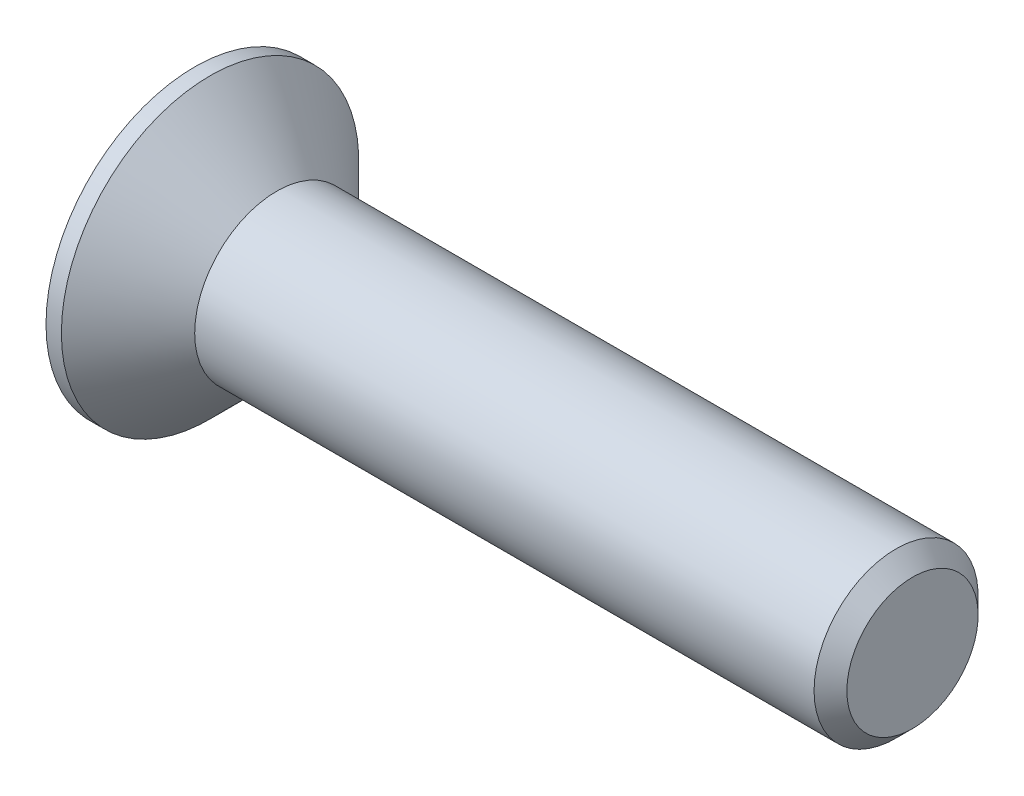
ISO-10303-21;
HEADER;
FILE_DESCRIPTION(('STEP AP214'),'2;1');
FILE_NAME('part.step','',(''),(''),'','','');
FILE_SCHEMA(('AUTOMOTIVE_DESIGN { 1 0 10303 214 1 1 1 1 }'));
ENDSEC;
DATA;
#1=APPLICATION_CONTEXT('core data for automotive mechanical design processes');
#2=APPLICATION_PROTOCOL_DEFINITION('international standard','automotive_design',2000,#1);
#3=PRODUCT_CONTEXT('',#1,'mechanical');
#4=PRODUCT('Part','Part','',(#3));
#5=PRODUCT_RELATED_PRODUCT_CATEGORY('part','',(#4));
#6=PRODUCT_DEFINITION_FORMATION('','',#4);
#7=PRODUCT_DEFINITION_CONTEXT('part definition',#1,'design');
#8=PRODUCT_DEFINITION('design','',#6,#7);
#9=PRODUCT_DEFINITION_SHAPE('','',#8);
#10=(LENGTH_UNIT() NAMED_UNIT(*) SI_UNIT(.MILLI.,.METRE.));
#11=(NAMED_UNIT(*) PLANE_ANGLE_UNIT() SI_UNIT($,.RADIAN.));
#12=(NAMED_UNIT(*) SI_UNIT($,.STERADIAN.) SOLID_ANGLE_UNIT());
#13=UNCERTAINTY_MEASURE_WITH_UNIT(LENGTH_MEASURE(1.E-05),#10,'distance_accuracy_value','');
#14=(GEOMETRIC_REPRESENTATION_CONTEXT(3) GLOBAL_UNCERTAINTY_ASSIGNED_CONTEXT((#13)) GLOBAL_UNIT_ASSIGNED_CONTEXT((#10,
#11,#12)) REPRESENTATION_CONTEXT('',''));
#15=CARTESIAN_POINT('',(0.,0.,0.));
#16=DIRECTION('',(0.,0.,1.));
#17=DIRECTION('',(1.,0.,0.));
#18=AXIS2_PLACEMENT_3D('',#15,#16,#17);
#19=CARTESIAN_POINT('',(0.,0.,0.));
#20=DIRECTION('',(-1.,0.,0.));
#21=DIRECTION('',(0.,0.,1.));
#22=AXIS2_PLACEMENT_3D('',#19,#20,#21);
#23=CONICAL_SURFACE('',#22,4.,0.78539816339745);
#24=CARTESIAN_POINT('',(-3.24999999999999,0.,0.));
#25=DIRECTION('',(-1.,0.,0.));
#26=DIRECTION('',(0.,0.,1.));
#27=AXIS2_PLACEMENT_3D('',#24,#25,#26);
#28=CIRCLE('',#27,7.25);
#29=CARTESIAN_POINT('',(-3.24999999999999,0.,7.25));
#30=VERTEX_POINT('',#29);
#31=EDGE_CURVE('E189',#30,#30,#28,.T.);
#32=ORIENTED_EDGE('',*,*,#31,.F.);
#33=EDGE_LOOP('',(#32));
#34=FACE_BOUND('',#33,.T.);
#35=CARTESIAN_POINT('',(0.,0.,0.));
#36=DIRECTION('',(-1.,0.,0.));
#37=DIRECTION('',(0.,0.,1.));
#38=AXIS2_PLACEMENT_3D('',#35,#36,#37);
#39=CIRCLE('',#38,4.);
#40=CARTESIAN_POINT('',(0.,0.,4.));
#41=VERTEX_POINT('',#40);
#42=EDGE_CURVE('E212',#41,#41,#39,.T.);
#43=ORIENTED_EDGE('',*,*,#42,.T.);
#44=EDGE_LOOP('',(#43));
#45=FACE_BOUND('',#44,.T.);
#46=ADVANCED_FACE('F33',(#34,#45),#23,.T.);
#47=CARTESIAN_POINT('',(-4.,0.,0.));
#48=DIRECTION('',(-1.,0.,0.));
#49=DIRECTION('',(0.,0.,1.));
#50=AXIS2_PLACEMENT_3D('',#47,#48,#49);
#51=CYLINDRICAL_SURFACE('',#50,4.);
#52=CARTESIAN_POINT('',(30.2,0.,0.));
#53=DIRECTION('',(-1.,0.,0.));
#54=DIRECTION('',(0.,0.,1.));
#55=AXIS2_PLACEMENT_3D('',#52,#53,#54);
#56=CIRCLE('',#55,4.);
#57=CARTESIAN_POINT('',(30.2,0.,4.));
#58=VERTEX_POINT('',#57);
#59=EDGE_CURVE('E41',#58,#58,#56,.T.);
#60=ORIENTED_EDGE('',*,*,#59,.T.);
#61=EDGE_LOOP('',(#60));
#62=FACE_BOUND('',#61,.T.);
#63=ORIENTED_EDGE('',*,*,#42,.F.);
#64=EDGE_LOOP('',(#63));
#65=FACE_BOUND('',#64,.T.);
#66=ADVANCED_FACE('F217',(#62,#65),#51,.T.);
#67=CARTESIAN_POINT('',(31.,0.,0.));
#68=DIRECTION('',(-1.,0.,0.));
#69=DIRECTION('',(0.,0.,1.));
#70=AXIS2_PLACEMENT_3D('',#67,#68,#69);
#71=PLANE('',#70);
#72=CARTESIAN_POINT('',(31.,0.,0.));
#73=DIRECTION('',(-1.,0.,0.));
#74=DIRECTION('',(0.,0.,1.));
#75=AXIS2_PLACEMENT_3D('',#72,#73,#74);
#76=CIRCLE('',#75,3.20000000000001);
#77=CARTESIAN_POINT('',(31.,0.,3.20000000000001));
#78=VERTEX_POINT('',#77);
#79=EDGE_CURVE('E11',#78,#78,#76,.F.);
#80=ORIENTED_EDGE('',*,*,#79,.T.);
#81=EDGE_LOOP('',(#80));
#82=FACE_BOUND('',#81,.T.);
#83=ADVANCED_FACE('F239',(#82),#71,.F.);
#84=CARTESIAN_POINT('',(-4.,7.25,0.));
#85=DIRECTION('',(1.,0.,0.));
#86=DIRECTION('',(0.,0.,-1.));
#87=AXIS2_PLACEMENT_3D('',#84,#85,#86);
#88=PLANE('',#87);
#89=DIRECTION('',(0.,0.,-1.));
#90=VECTOR('',#89,1.);
#91=CARTESIAN_POINT('',(-4.,1.09,-4.35));
#92=LINE('',#91,#90);
#93=CARTESIAN_POINT('',(-4.,1.09,-1.09));
#94=VERTEX_POINT('',#93);
#95=CARTESIAN_POINT('',(-4.,1.09,-4.35));
#96=VERTEX_POINT('',#95);
#97=EDGE_CURVE('E158',#94,#96,#92,.T.);
#98=ORIENTED_EDGE('',*,*,#97,.F.);
#99=DIRECTION('',(0.,-1.,0.));
#100=VECTOR('',#99,1.);
#101=CARTESIAN_POINT('',(-4.,1.09,-1.09));
#102=LINE('',#101,#100);
#103=CARTESIAN_POINT('',(-4.,4.35,-1.09));
#104=VERTEX_POINT('',#103);
#105=EDGE_CURVE('E48',#104,#94,#102,.T.);
#106=ORIENTED_EDGE('',*,*,#105,.F.);
#107=DIRECTION('',(0.,0.,-1.));
#108=VECTOR('',#107,1.);
#109=CARTESIAN_POINT('',(-4.,4.35,-1.09));
#110=LINE('',#109,#108);
#111=CARTESIAN_POINT('',(-4.,4.35,1.09));
#112=VERTEX_POINT('',#111);
#113=EDGE_CURVE('E185',#112,#104,#110,.T.);
#114=ORIENTED_EDGE('',*,*,#113,.F.);
#115=DIRECTION('',(0.,1.,0.));
#116=VECTOR('',#115,1.);
#117=CARTESIAN_POINT('',(-4.,4.35,1.09));
#118=LINE('',#117,#116);
#119=CARTESIAN_POINT('',(-4.,1.09,1.09));
#120=VERTEX_POINT('',#119);
#121=EDGE_CURVE('E183',#120,#112,#118,.T.);
#122=ORIENTED_EDGE('',*,*,#121,.F.);
#123=DIRECTION('',(0.,0.,-1.));
#124=VECTOR('',#123,1.);
#125=CARTESIAN_POINT('',(-4.,1.09,1.09));
#126=LINE('',#125,#124);
#127=CARTESIAN_POINT('',(-4.,1.09,4.35));
#128=VERTEX_POINT('',#127);
#129=EDGE_CURVE('E132',#128,#120,#126,.T.);
#130=ORIENTED_EDGE('',*,*,#129,.F.);
#131=DIRECTION('',(0.,1.,0.));
#132=VECTOR('',#131,1.);
#133=CARTESIAN_POINT('',(-4.,1.09,4.35));
#134=LINE('',#133,#132);
#135=CARTESIAN_POINT('',(-4.,-1.09,4.35));
#136=VERTEX_POINT('',#135);
#137=EDGE_CURVE('E179',#136,#128,#134,.T.);
#138=ORIENTED_EDGE('',*,*,#137,.F.);
#139=DIRECTION('',(0.,0.,1.));
#140=VECTOR('',#139,1.);
#141=CARTESIAN_POINT('',(-4.,-1.09,4.35));
#142=LINE('',#141,#140);
#143=CARTESIAN_POINT('',(-4.,-1.09,1.09));
#144=VERTEX_POINT('',#143);
#145=EDGE_CURVE('E176',#144,#136,#142,.T.);
#146=ORIENTED_EDGE('',*,*,#145,.F.);
#147=DIRECTION('',(0.,1.,0.));
#148=VECTOR('',#147,1.);
#149=CARTESIAN_POINT('',(-4.,-1.09,1.09));
#150=LINE('',#149,#148);
#151=CARTESIAN_POINT('',(-4.,-4.35,1.09));
#152=VERTEX_POINT('',#151);
#153=EDGE_CURVE('E173',#152,#144,#150,.T.);
#154=ORIENTED_EDGE('',*,*,#153,.F.);
#155=DIRECTION('',(0.,0.,1.));
#156=VECTOR('',#155,1.);
#157=CARTESIAN_POINT('',(-4.,-4.35,1.09));
#158=LINE('',#157,#156);
#159=CARTESIAN_POINT('',(-4.,-4.35,-1.09));
#160=VERTEX_POINT('',#159);
#161=EDGE_CURVE('E170',#160,#152,#158,.T.);
#162=ORIENTED_EDGE('',*,*,#161,.F.);
#163=DIRECTION('',(0.,-1.,0.));
#164=VECTOR('',#163,1.);
#165=CARTESIAN_POINT('',(-4.,-4.35,-1.09));
#166=LINE('',#165,#164);
#167=CARTESIAN_POINT('',(-4.,-1.09,-1.09));
#168=VERTEX_POINT('',#167);
#169=EDGE_CURVE('E167',#168,#160,#166,.T.);
#170=ORIENTED_EDGE('',*,*,#169,.F.);
#171=DIRECTION('',(0.,0.,1.));
#172=VECTOR('',#171,1.);
#173=CARTESIAN_POINT('',(-4.,-1.09,-1.09));
#174=LINE('',#173,#172);
#175=CARTESIAN_POINT('',(-4.,-1.09,-4.35));
#176=VERTEX_POINT('',#175);
#177=EDGE_CURVE('E164',#176,#168,#174,.T.);
#178=ORIENTED_EDGE('',*,*,#177,.F.);
#179=DIRECTION('',(0.,-1.,0.));
#180=VECTOR('',#179,1.);
#181=CARTESIAN_POINT('',(-4.,-1.09,-4.35));
#182=LINE('',#181,#180);
#183=EDGE_CURVE('E161',#96,#176,#182,.T.);
#184=ORIENTED_EDGE('',*,*,#183,.F.);
#185=EDGE_LOOP('',(#98,#106,#114,#122,#130,#138,#146,#154,#162,#170,#178,#184));
#186=FACE_BOUND('',#185,.T.);
#187=CARTESIAN_POINT('',(-4.,0.,0.));
#188=DIRECTION('',(-1.,0.,0.));
#189=DIRECTION('',(0.,0.,1.));
#190=AXIS2_PLACEMENT_3D('',#187,#188,#189);
#191=CIRCLE('',#190,7.25);
#192=CARTESIAN_POINT('',(-4.,0.,7.25));
#193=VERTEX_POINT('',#192);
#194=EDGE_CURVE('E209',#193,#193,#191,.T.);
#195=ORIENTED_EDGE('',*,*,#194,.T.);
#196=EDGE_LOOP('',(#195));
#197=FACE_BOUND('',#196,.T.);
#198=ADVANCED_FACE('F230',(#186,#197),#88,.F.);
#199=CARTESIAN_POINT('',(-4.,0.,0.));
#200=DIRECTION('',(-1.,0.,0.));
#201=DIRECTION('',(0.,0.,1.));
#202=AXIS2_PLACEMENT_3D('',#199,#200,#201);
#203=CYLINDRICAL_SURFACE('',#202,7.25);
#204=ORIENTED_EDGE('',*,*,#194,.F.);
#205=EDGE_LOOP('',(#204));
#206=FACE_BOUND('',#205,.T.);
#207=ORIENTED_EDGE('',*,*,#31,.T.);
#208=EDGE_LOOP('',(#207));
#209=FACE_BOUND('',#208,.T.);
#210=ADVANCED_FACE('F222',(#206,#209),#203,.T.);
#211=CARTESIAN_POINT('',(30.2,0.,0.));
#212=DIRECTION('',(-1.,0.,0.));
#213=DIRECTION('',(0.,0.,1.));
#214=AXIS2_PLACEMENT_3D('',#211,#212,#213);
#215=CONICAL_SURFACE('',#214,4.,0.785398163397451);
#216=ORIENTED_EDGE('',*,*,#79,.F.);
#217=EDGE_LOOP('',(#216));
#218=FACE_BOUND('',#217,.T.);
#219=ORIENTED_EDGE('',*,*,#59,.F.);
#220=EDGE_LOOP('',(#219));
#221=FACE_BOUND('',#220,.T.);
#222=ADVANCED_FACE('F35',(#218,#221),#215,.T.);
#223=CARTESIAN_POINT('',(-0.55,1.09,-1.09));
#224=DIRECTION('',(0.,0.,-1.));
#225=DIRECTION('',(-1.,0.,0.));
#226=AXIS2_PLACEMENT_3D('',#223,#224,#225);
#227=PLANE('',#226);
#228=ORIENTED_EDGE('',*,*,#105,.T.);
#229=DIRECTION('',(-1.,0.,0.));
#230=VECTOR('',#229,1.);
#231=CARTESIAN_POINT('',(-0.55,1.09,-1.09));
#232=LINE('',#231,#230);
#233=CARTESIAN_POINT('',(-0.55,1.09,-1.09));
#234=VERTEX_POINT('',#233);
#235=EDGE_CURVE('E96',#234,#94,#232,.T.);
#236=ORIENTED_EDGE('',*,*,#235,.F.);
#237=DIRECTION('',(0.,-1.,0.));
#238=VECTOR('',#237,1.);
#239=CARTESIAN_POINT('',(-0.55,1.09,-1.09));
#240=LINE('',#239,#238);
#241=CARTESIAN_POINT('',(-0.55,4.35,-1.09));
#242=VERTEX_POINT('',#241);
#243=EDGE_CURVE('E187',#242,#234,#240,.T.);
#244=ORIENTED_EDGE('',*,*,#243,.F.);
#245=DIRECTION('',(-1.,0.,0.));
#246=VECTOR('',#245,1.);
#247=CARTESIAN_POINT('',(-0.55,4.35,-1.09));
#248=LINE('',#247,#246);
#249=EDGE_CURVE('E56',#242,#104,#248,.T.);
#250=ORIENTED_EDGE('',*,*,#249,.T.);
#251=EDGE_LOOP('',(#228,#236,#244,#250));
#252=FACE_BOUND('',#251,.T.);
#253=ADVANCED_FACE('F221',(#252),#227,.F.);
#254=CARTESIAN_POINT('',(-0.55,4.35,-1.09));
#255=DIRECTION('',(0.,1.,0.));
#256=DIRECTION('',(-1.,0.,0.));
#257=AXIS2_PLACEMENT_3D('',#254,#255,#256);
#258=PLANE('',#257);
#259=ORIENTED_EDGE('',*,*,#113,.T.);
#260=ORIENTED_EDGE('',*,*,#249,.F.);
#261=DIRECTION('',(0.,0.,-1.));
#262=VECTOR('',#261,1.);
#263=CARTESIAN_POINT('',(-0.55,4.35,-1.09));
#264=LINE('',#263,#262);
#265=CARTESIAN_POINT('',(-0.55,4.35,1.09));
#266=VERTEX_POINT('',#265);
#267=EDGE_CURVE('E144',#266,#242,#264,.T.);
#268=ORIENTED_EDGE('',*,*,#267,.F.);
#269=DIRECTION('',(-1.,0.,0.));
#270=VECTOR('',#269,1.);
#271=CARTESIAN_POINT('',(-0.55,4.35,1.09));
#272=LINE('',#271,#270);
#273=EDGE_CURVE('E136',#266,#112,#272,.T.);
#274=ORIENTED_EDGE('',*,*,#273,.T.);
#275=EDGE_LOOP('',(#259,#260,#268,#274));
#276=FACE_BOUND('',#275,.T.);
#277=ADVANCED_FACE('F228',(#276),#258,.F.);
#278=CARTESIAN_POINT('',(-0.55,4.35,1.09));
#279=DIRECTION('',(0.,0.,1.));
#280=DIRECTION('',(1.,0.,0.));
#281=AXIS2_PLACEMENT_3D('',#278,#279,#280);
#282=PLANE('',#281);
#283=ORIENTED_EDGE('',*,*,#121,.T.);
#284=ORIENTED_EDGE('',*,*,#273,.F.);
#285=DIRECTION('',(0.,1.,0.));
#286=VECTOR('',#285,1.);
#287=CARTESIAN_POINT('',(-0.55,4.35,1.09));
#288=LINE('',#287,#286);
#289=CARTESIAN_POINT('',(-0.55,1.09,1.09));
#290=VERTEX_POINT('',#289);
#291=EDGE_CURVE('E140',#290,#266,#288,.T.);
#292=ORIENTED_EDGE('',*,*,#291,.F.);
#293=DIRECTION('',(-1.,0.,0.));
#294=VECTOR('',#293,1.);
#295=CARTESIAN_POINT('',(-0.55,1.09,1.09));
#296=LINE('',#295,#294);
#297=EDGE_CURVE('E125',#290,#120,#296,.T.);
#298=ORIENTED_EDGE('',*,*,#297,.T.);
#299=EDGE_LOOP('',(#283,#284,#292,#298));
#300=FACE_BOUND('',#299,.T.);
#301=ADVANCED_FACE('F141',(#300),#282,.F.);
#302=CARTESIAN_POINT('',(-0.55,1.09,1.09));
#303=DIRECTION('',(0.,1.,0.));
#304=DIRECTION('',(-1.,0.,0.));
#305=AXIS2_PLACEMENT_3D('',#302,#303,#304);
#306=PLANE('',#305);
#307=ORIENTED_EDGE('',*,*,#129,.T.);
#308=ORIENTED_EDGE('',*,*,#297,.F.);
#309=DIRECTION('',(0.,0.,-1.));
#310=VECTOR('',#309,1.);
#311=CARTESIAN_POINT('',(-0.55,1.09,1.09));
#312=LINE('',#311,#310);
#313=CARTESIAN_POINT('',(-0.55,1.09,4.35));
#314=VERTEX_POINT('',#313);
#315=EDGE_CURVE('E129',#314,#290,#312,.T.);
#316=ORIENTED_EDGE('',*,*,#315,.F.);
#317=DIRECTION('',(-1.,0.,0.));
#318=VECTOR('',#317,1.);
#319=CARTESIAN_POINT('',(-0.55,1.09,4.35));
#320=LINE('',#319,#318);
#321=EDGE_CURVE('E137',#314,#128,#320,.T.);
#322=ORIENTED_EDGE('',*,*,#321,.T.);
#323=EDGE_LOOP('',(#307,#308,#316,#322));
#324=FACE_BOUND('',#323,.T.);
#325=ADVANCED_FACE('F127',(#324),#306,.F.);
#326=CARTESIAN_POINT('',(-0.55,1.09,4.35));
#327=DIRECTION('',(0.,0.,1.));
#328=DIRECTION('',(1.,0.,0.));
#329=AXIS2_PLACEMENT_3D('',#326,#327,#328);
#330=PLANE('',#329);
#331=ORIENTED_EDGE('',*,*,#137,.T.);
#332=ORIENTED_EDGE('',*,*,#321,.F.);
#333=DIRECTION('',(0.,1.,0.));
#334=VECTOR('',#333,1.);
#335=CARTESIAN_POINT('',(-0.55,1.09,4.35));
#336=LINE('',#335,#334);
#337=CARTESIAN_POINT('',(-0.55,-1.09,4.35));
#338=VERTEX_POINT('',#337);
#339=EDGE_CURVE('E150',#338,#314,#336,.T.);
#340=ORIENTED_EDGE('',*,*,#339,.F.);
#341=DIRECTION('',(-1.,0.,0.));
#342=VECTOR('',#341,1.);
#343=CARTESIAN_POINT('',(-0.55,-1.09,4.35));
#344=LINE('',#343,#342);
#345=EDGE_CURVE('E192',#338,#136,#344,.T.);
#346=ORIENTED_EDGE('',*,*,#345,.T.);
#347=EDGE_LOOP('',(#331,#332,#340,#346));
#348=FACE_BOUND('',#347,.T.);
#349=ADVANCED_FACE('F277',(#348),#330,.F.);
#350=CARTESIAN_POINT('',(-0.55,-1.09,4.35));
#351=DIRECTION('',(0.,-1.,0.));
#352=DIRECTION('',(1.,0.,0.));
#353=AXIS2_PLACEMENT_3D('',#350,#351,#352);
#354=PLANE('',#353);
#355=ORIENTED_EDGE('',*,*,#145,.T.);
#356=ORIENTED_EDGE('',*,*,#345,.F.);
#357=DIRECTION('',(0.,0.,1.));
#358=VECTOR('',#357,1.);
#359=CARTESIAN_POINT('',(-0.55,-1.09,4.35));
#360=LINE('',#359,#358);
#361=CARTESIAN_POINT('',(-0.55,-1.09,1.09));
#362=VERTEX_POINT('',#361);
#363=EDGE_CURVE('E152',#362,#338,#360,.T.);
#364=ORIENTED_EDGE('',*,*,#363,.F.);
#365=DIRECTION('',(-1.,0.,0.));
#366=VECTOR('',#365,1.);
#367=CARTESIAN_POINT('',(-0.55,-1.09,1.09));
#368=LINE('',#367,#366);
#369=EDGE_CURVE('E194',#362,#144,#368,.T.);
#370=ORIENTED_EDGE('',*,*,#369,.T.);
#371=EDGE_LOOP('',(#355,#356,#364,#370));
#372=FACE_BOUND('',#371,.T.);
#373=ADVANCED_FACE('F273',(#372),#354,.F.);
#374=CARTESIAN_POINT('',(-0.55,-1.09,1.09));
#375=DIRECTION('',(0.,0.,1.));
#376=DIRECTION('',(1.,0.,0.));
#377=AXIS2_PLACEMENT_3D('',#374,#375,#376);
#378=PLANE('',#377);
#379=ORIENTED_EDGE('',*,*,#153,.T.);
#380=ORIENTED_EDGE('',*,*,#369,.F.);
#381=DIRECTION('',(0.,1.,0.));
#382=VECTOR('',#381,1.);
#383=CARTESIAN_POINT('',(-0.55,-1.09,1.09));
#384=LINE('',#383,#382);
#385=CARTESIAN_POINT('',(-0.55,-4.35,1.09));
#386=VERTEX_POINT('',#385);
#387=EDGE_CURVE('E422',#386,#362,#384,.T.);
#388=ORIENTED_EDGE('',*,*,#387,.F.);
#389=DIRECTION('',(-1.,0.,0.));
#390=VECTOR('',#389,1.);
#391=CARTESIAN_POINT('',(-0.55,-4.35,1.09));
#392=LINE('',#391,#390);
#393=EDGE_CURVE('E196',#386,#152,#392,.T.);
#394=ORIENTED_EDGE('',*,*,#393,.T.);
#395=EDGE_LOOP('',(#379,#380,#388,#394));
#396=FACE_BOUND('',#395,.T.);
#397=ADVANCED_FACE('F269',(#396),#378,.F.);
#398=CARTESIAN_POINT('',(-0.55,-4.35,1.09));
#399=DIRECTION('',(0.,-1.,0.));
#400=DIRECTION('',(1.,0.,0.));
#401=AXIS2_PLACEMENT_3D('',#398,#399,#400);
#402=PLANE('',#401);
#403=ORIENTED_EDGE('',*,*,#161,.T.);
#404=ORIENTED_EDGE('',*,*,#393,.F.);
#405=DIRECTION('',(0.,0.,1.));
#406=VECTOR('',#405,1.);
#407=CARTESIAN_POINT('',(-0.55,-4.35,1.09));
#408=LINE('',#407,#406);
#409=CARTESIAN_POINT('',(-0.55,-4.35,-1.09));
#410=VERTEX_POINT('',#409);
#411=EDGE_CURVE('E419',#410,#386,#408,.T.);
#412=ORIENTED_EDGE('',*,*,#411,.F.);
#413=DIRECTION('',(-1.,0.,0.));
#414=VECTOR('',#413,1.);
#415=CARTESIAN_POINT('',(-0.55,-4.35,-1.09));
#416=LINE('',#415,#414);
#417=EDGE_CURVE('E198',#410,#160,#416,.T.);
#418=ORIENTED_EDGE('',*,*,#417,.T.);
#419=EDGE_LOOP('',(#403,#404,#412,#418));
#420=FACE_BOUND('',#419,.T.);
#421=ADVANCED_FACE('F265',(#420),#402,.F.);
#422=CARTESIAN_POINT('',(-0.55,-4.35,-1.09));
#423=DIRECTION('',(0.,0.,-1.));
#424=DIRECTION('',(-1.,0.,0.));
#425=AXIS2_PLACEMENT_3D('',#422,#423,#424);
#426=PLANE('',#425);
#427=ORIENTED_EDGE('',*,*,#169,.T.);
#428=ORIENTED_EDGE('',*,*,#417,.F.);
#429=DIRECTION('',(0.,-1.,0.));
#430=VECTOR('',#429,1.);
#431=CARTESIAN_POINT('',(-0.55,-4.35,-1.09));
#432=LINE('',#431,#430);
#433=CARTESIAN_POINT('',(-0.55,-1.09,-1.09));
#434=VERTEX_POINT('',#433);
#435=EDGE_CURVE('E416',#434,#410,#432,.T.);
#436=ORIENTED_EDGE('',*,*,#435,.F.);
#437=DIRECTION('',(-1.,0.,0.));
#438=VECTOR('',#437,1.);
#439=CARTESIAN_POINT('',(-0.55,-1.09,-1.09));
#440=LINE('',#439,#438);
#441=EDGE_CURVE('E200',#434,#168,#440,.T.);
#442=ORIENTED_EDGE('',*,*,#441,.T.);
#443=EDGE_LOOP('',(#427,#428,#436,#442));
#444=FACE_BOUND('',#443,.T.);
#445=ADVANCED_FACE('F261',(#444),#426,.F.);
#446=CARTESIAN_POINT('',(-0.55,-1.09,-1.09));
#447=DIRECTION('',(0.,-1.,0.));
#448=DIRECTION('',(1.,0.,0.));
#449=AXIS2_PLACEMENT_3D('',#446,#447,#448);
#450=PLANE('',#449);
#451=ORIENTED_EDGE('',*,*,#177,.T.);
#452=ORIENTED_EDGE('',*,*,#441,.F.);
#453=DIRECTION('',(0.,0.,1.));
#454=VECTOR('',#453,1.);
#455=CARTESIAN_POINT('',(-0.55,-1.09,-1.09));
#456=LINE('',#455,#454);
#457=CARTESIAN_POINT('',(-0.55,-1.09,-4.35));
#458=VERTEX_POINT('',#457);
#459=EDGE_CURVE('E413',#458,#434,#456,.T.);
#460=ORIENTED_EDGE('',*,*,#459,.F.);
#461=DIRECTION('',(-1.,0.,0.));
#462=VECTOR('',#461,1.);
#463=CARTESIAN_POINT('',(-0.55,-1.09,-4.35));
#464=LINE('',#463,#462);
#465=EDGE_CURVE('E202',#458,#176,#464,.T.);
#466=ORIENTED_EDGE('',*,*,#465,.T.);
#467=EDGE_LOOP('',(#451,#452,#460,#466));
#468=FACE_BOUND('',#467,.T.);
#469=ADVANCED_FACE('F257',(#468),#450,.F.);
#470=CARTESIAN_POINT('',(-0.55,-1.09,-4.35));
#471=DIRECTION('',(0.,0.,-1.));
#472=DIRECTION('',(-1.,0.,0.));
#473=AXIS2_PLACEMENT_3D('',#470,#471,#472);
#474=PLANE('',#473);
#475=ORIENTED_EDGE('',*,*,#183,.T.);
#476=ORIENTED_EDGE('',*,*,#465,.F.);
#477=DIRECTION('',(0.,-1.,0.));
#478=VECTOR('',#477,1.);
#479=CARTESIAN_POINT('',(-0.55,-1.09,-4.35));
#480=LINE('',#479,#478);
#481=CARTESIAN_POINT('',(-0.55,1.09,-4.35));
#482=VERTEX_POINT('',#481);
#483=EDGE_CURVE('E408',#482,#458,#480,.T.);
#484=ORIENTED_EDGE('',*,*,#483,.F.);
#485=DIRECTION('',(-1.,0.,0.));
#486=VECTOR('',#485,1.);
#487=CARTESIAN_POINT('',(-0.55,1.09,-4.35));
#488=LINE('',#487,#486);
#489=EDGE_CURVE('E204',#482,#96,#488,.T.);
#490=ORIENTED_EDGE('',*,*,#489,.T.);
#491=EDGE_LOOP('',(#475,#476,#484,#490));
#492=FACE_BOUND('',#491,.T.);
#493=ADVANCED_FACE('F253',(#492),#474,.F.);
#494=CARTESIAN_POINT('',(-0.55,1.09,-4.35));
#495=DIRECTION('',(0.,1.,0.));
#496=DIRECTION('',(-1.,0.,0.));
#497=AXIS2_PLACEMENT_3D('',#494,#495,#496);
#498=PLANE('',#497);
#499=ORIENTED_EDGE('',*,*,#97,.T.);
#500=ORIENTED_EDGE('',*,*,#489,.F.);
#501=DIRECTION('',(0.,0.,-1.));
#502=VECTOR('',#501,1.);
#503=CARTESIAN_POINT('',(-0.55,1.09,-4.35));
#504=LINE('',#503,#502);
#505=EDGE_CURVE('E406',#234,#482,#504,.T.);
#506=ORIENTED_EDGE('',*,*,#505,.F.);
#507=ORIENTED_EDGE('',*,*,#235,.T.);
#508=EDGE_LOOP('',(#499,#500,#506,#507));
#509=FACE_BOUND('',#508,.T.);
#510=ADVANCED_FACE('F250',(#509),#498,.F.);
#511=CARTESIAN_POINT('',(-0.55,0.,0.));
#512=DIRECTION('',(1.,0.,0.));
#513=DIRECTION('',(0.,0.,-1.));
#514=AXIS2_PLACEMENT_3D('',#511,#512,#513);
#515=PLANE('',#514);
#516=ORIENTED_EDGE('',*,*,#243,.T.);
#517=ORIENTED_EDGE('',*,*,#505,.T.);
#518=ORIENTED_EDGE('',*,*,#483,.T.);
#519=ORIENTED_EDGE('',*,*,#459,.T.);
#520=ORIENTED_EDGE('',*,*,#435,.T.);
#521=ORIENTED_EDGE('',*,*,#411,.T.);
#522=ORIENTED_EDGE('',*,*,#387,.T.);
#523=ORIENTED_EDGE('',*,*,#363,.T.);
#524=ORIENTED_EDGE('',*,*,#339,.T.);
#525=ORIENTED_EDGE('',*,*,#315,.T.);
#526=ORIENTED_EDGE('',*,*,#291,.T.);
#527=ORIENTED_EDGE('',*,*,#267,.T.);
#528=EDGE_LOOP('',(#516,#517,#518,#519,#520,#521,#522,#523,#524,#525,#526,#527));
#529=FACE_BOUND('',#528,.T.);
#530=ADVANCED_FACE('F147',(#529),#515,.F.);
#531=CLOSED_SHELL('',(#46,#66,#83,#198,#210,#222,#253,#277,#301,#325,#349,#373,#397,#421,#445,
#469,#493,#510,#530));
#532=MANIFOLD_SOLID_BREP('B2',#531);
#533=ADVANCED_BREP_SHAPE_REPRESENTATION('',(#18,#532),#14);
#534=SHAPE_DEFINITION_REPRESENTATION(#9,#533);
ENDSEC;
END-ISO-10303-21;
